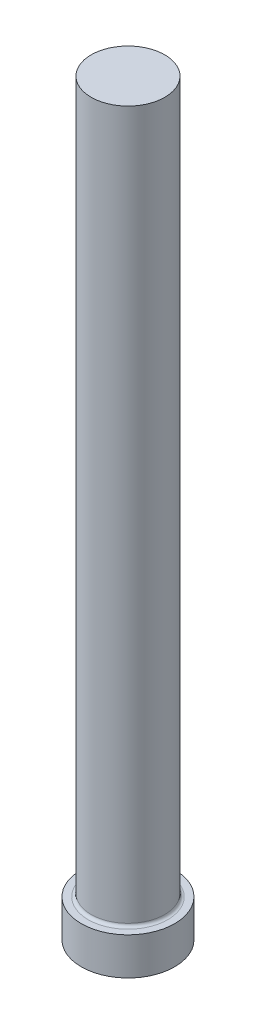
ISO-10303-21;
HEADER;
FILE_DESCRIPTION(('STEP AP214'),'2;1');
FILE_NAME('part.step','',(''),(''),'','','');
FILE_SCHEMA(('AUTOMOTIVE_DESIGN { 1 0 10303 214 1 1 1 1 }'));
ENDSEC;
DATA;
#1=APPLICATION_CONTEXT('core data for automotive mechanical design processes');
#2=APPLICATION_PROTOCOL_DEFINITION('international standard','automotive_design',2000,#1);
#3=PRODUCT_CONTEXT('',#1,'mechanical');
#4=PRODUCT('Part','Part','',(#3));
#5=PRODUCT_RELATED_PRODUCT_CATEGORY('part','',(#4));
#6=PRODUCT_DEFINITION_FORMATION('','',#4);
#7=PRODUCT_DEFINITION_CONTEXT('part definition',#1,'design');
#8=PRODUCT_DEFINITION('design','',#6,#7);
#9=PRODUCT_DEFINITION_SHAPE('','',#8);
#10=(LENGTH_UNIT() NAMED_UNIT(*) SI_UNIT(.MILLI.,.METRE.));
#11=(NAMED_UNIT(*) PLANE_ANGLE_UNIT() SI_UNIT($,.RADIAN.));
#12=(NAMED_UNIT(*) SI_UNIT($,.STERADIAN.) SOLID_ANGLE_UNIT());
#13=UNCERTAINTY_MEASURE_WITH_UNIT(LENGTH_MEASURE(1.E-05),#10,'distance_accuracy_value','');
#14=(GEOMETRIC_REPRESENTATION_CONTEXT(3) GLOBAL_UNCERTAINTY_ASSIGNED_CONTEXT((#13)) GLOBAL_UNIT_ASSIGNED_CONTEXT((#10,
#11,#12)) REPRESENTATION_CONTEXT('',''));
#15=CARTESIAN_POINT('',(0.,0.,0.));
#16=DIRECTION('',(0.,0.,1.));
#17=DIRECTION('',(1.,0.,0.));
#18=AXIS2_PLACEMENT_3D('',#15,#16,#17);
#19=CARTESIAN_POINT('',(0.,63.5,0.));
#20=DIRECTION('',(0.,-1.,0.));
#21=DIRECTION('',(0.,0.,-1.));
#22=AXIS2_PLACEMENT_3D('',#19,#20,#21);
#23=PLANE('',#22);
#24=CARTESIAN_POINT('',(0.,63.5,0.));
#25=DIRECTION('',(0.,1.,0.));
#26=DIRECTION('',(0.,0.,1.));
#27=AXIS2_PLACEMENT_3D('',#24,#25,#26);
#28=CIRCLE('',#27,3.1242);
#29=CARTESIAN_POINT('',(0.,63.5,3.1242));
#30=VERTEX_POINT('',#29);
#31=EDGE_CURVE('E10',#30,#30,#28,.T.);
#32=ORIENTED_EDGE('',*,*,#31,.T.);
#33=EDGE_LOOP('',(#32));
#34=FACE_BOUND('',#33,.T.);
#35=ADVANCED_FACE('F30',(#34),#23,.F.);
#36=CARTESIAN_POINT('',(0.,0.,0.));
#37=DIRECTION('',(0.,1.,0.));
#38=DIRECTION('',(0.,0.,1.));
#39=AXIS2_PLACEMENT_3D('',#36,#37,#38);
#40=CYLINDRICAL_SURFACE('',#39,3.1242);
#41=ORIENTED_EDGE('',*,*,#31,.F.);
#42=EDGE_LOOP('',(#41));
#43=FACE_BOUND('',#42,.T.);
#44=CARTESIAN_POINT('',(0.,3.429,0.));
#45=DIRECTION('',(0.,1.,0.));
#46=DIRECTION('',(0.,0.,1.));
#47=AXIS2_PLACEMENT_3D('',#44,#45,#46);
#48=CIRCLE('',#47,3.1242);
#49=CARTESIAN_POINT('',(0.,3.429,3.1242));
#50=VERTEX_POINT('',#49);
#51=EDGE_CURVE('E36',#50,#50,#48,.T.);
#52=ORIENTED_EDGE('',*,*,#51,.T.);
#53=EDGE_LOOP('',(#52));
#54=FACE_BOUND('',#53,.T.);
#55=ADVANCED_FACE('F65',(#43,#54),#40,.T.);
#56=CARTESIAN_POINT('',(0.,3.429,0.));
#57=DIRECTION('',(0.,1.,0.));
#58=DIRECTION('',(0.,0.,1.));
#59=AXIS2_PLACEMENT_3D('',#56,#57,#58);
#60=TOROIDAL_SURFACE('',#59,3.3782,0.254);
#61=ORIENTED_EDGE('',*,*,#51,.F.);
#62=EDGE_LOOP('',(#61));
#63=FACE_BOUND('',#62,.T.);
#64=CARTESIAN_POINT('',(0.,3.175,0.));
#65=DIRECTION('',(0.,1.,0.));
#66=DIRECTION('',(0.,0.,1.));
#67=AXIS2_PLACEMENT_3D('',#64,#65,#66);
#68=CIRCLE('',#67,3.3782);
#69=CARTESIAN_POINT('',(0.,3.175,3.3782));
#70=VERTEX_POINT('',#69);
#71=EDGE_CURVE('E40',#70,#70,#68,.T.);
#72=ORIENTED_EDGE('',*,*,#71,.T.);
#73=EDGE_LOOP('',(#72));
#74=FACE_BOUND('',#73,.T.);
#75=ADVANCED_FACE('F69',(#63,#74),#60,.F.);
#76=CARTESIAN_POINT('',(3.9624,3.175,0.));
#77=DIRECTION('',(0.,-1.,0.));
#78=DIRECTION('',(0.,0.,-1.));
#79=AXIS2_PLACEMENT_3D('',#76,#77,#78);
#80=PLANE('',#79);
#81=ORIENTED_EDGE('',*,*,#71,.F.);
#82=EDGE_LOOP('',(#81));
#83=FACE_BOUND('',#82,.T.);
#84=CARTESIAN_POINT('',(0.,3.175,0.));
#85=DIRECTION('',(0.,1.,0.));
#86=DIRECTION('',(0.,0.,1.));
#87=AXIS2_PLACEMENT_3D('',#84,#85,#86);
#88=CIRCLE('',#87,3.9624);
#89=CARTESIAN_POINT('',(0.,3.175,3.9624));
#90=VERTEX_POINT('',#89);
#91=EDGE_CURVE('E44',#90,#90,#88,.T.);
#92=ORIENTED_EDGE('',*,*,#91,.T.);
#93=EDGE_LOOP('',(#92));
#94=FACE_BOUND('',#93,.T.);
#95=ADVANCED_FACE('F61',(#83,#94),#80,.F.);
#96=CARTESIAN_POINT('',(0.,0.,0.));
#97=DIRECTION('',(0.,1.,0.));
#98=DIRECTION('',(0.,0.,1.));
#99=AXIS2_PLACEMENT_3D('',#96,#97,#98);
#100=CYLINDRICAL_SURFACE('',#99,3.9624);
#101=ORIENTED_EDGE('',*,*,#91,.F.);
#102=EDGE_LOOP('',(#101));
#103=FACE_BOUND('',#102,.T.);
#104=CARTESIAN_POINT('',(0.,0.,0.));
#105=DIRECTION('',(0.,1.,0.));
#106=DIRECTION('',(0.,0.,1.));
#107=AXIS2_PLACEMENT_3D('',#104,#105,#106);
#108=CIRCLE('',#107,3.9624);
#109=CARTESIAN_POINT('',(0.,0.,3.9624));
#110=VERTEX_POINT('',#109);
#111=EDGE_CURVE('E49',#110,#110,#108,.T.);
#112=ORIENTED_EDGE('',*,*,#111,.T.);
#113=EDGE_LOOP('',(#112));
#114=FACE_BOUND('',#113,.T.);
#115=ADVANCED_FACE('F53',(#103,#114),#100,.T.);
#116=CARTESIAN_POINT('',(0.,0.,0.));
#117=DIRECTION('',(0.,1.,0.));
#118=DIRECTION('',(0.,0.,1.));
#119=AXIS2_PLACEMENT_3D('',#116,#117,#118);
#120=PLANE('',#119);
#121=ORIENTED_EDGE('',*,*,#111,.F.);
#122=EDGE_LOOP('',(#121));
#123=FACE_BOUND('',#122,.T.);
#124=ADVANCED_FACE('F55',(#123),#120,.F.);
#125=CLOSED_SHELL('',(#35,#55,#75,#95,#115,#124));
#126=MANIFOLD_SOLID_BREP('B2',#125);
#127=ADVANCED_BREP_SHAPE_REPRESENTATION('',(#18,#126),#14);
#128=SHAPE_DEFINITION_REPRESENTATION(#9,#127);
ENDSEC;
END-ISO-10303-21;
